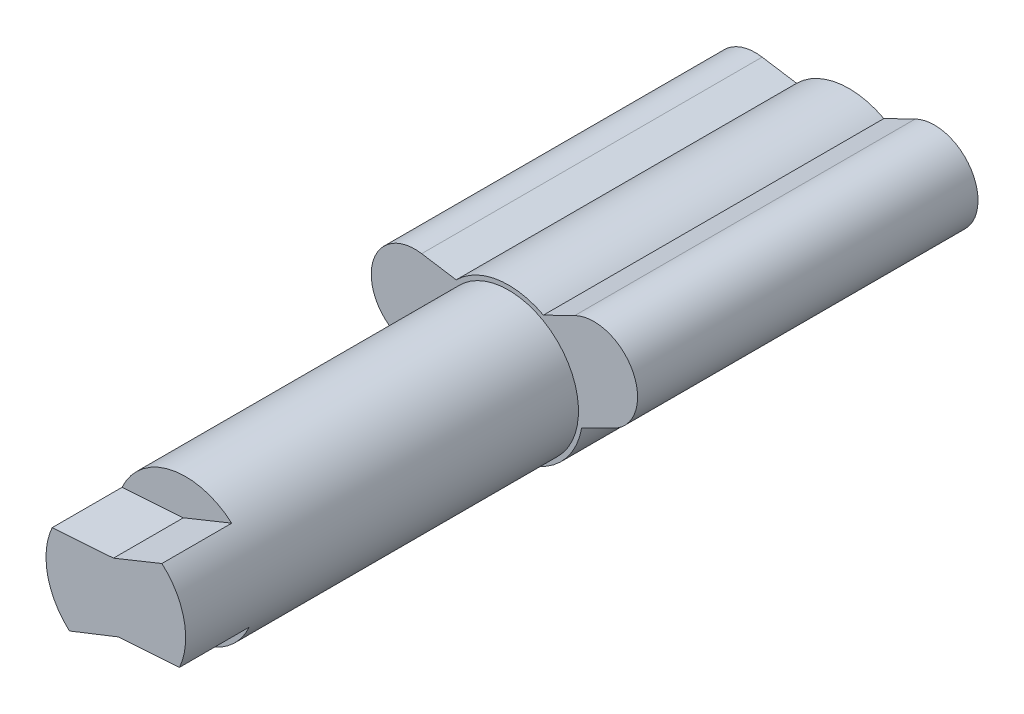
from build123d import *

# Parameters (mm, degrees)
ESQUISSE1_R             = 4
EXTRUSION1_DEPTH        = 42
ENL_V_START             = -4
ENL_V_MAT_EXTRU_1_DEPTH = 4
EXTRUSION2_DEPTH        = 19.5


with BuildPart() as part:
    # Esquisse1 → Extrusion1 (new body)
    with BuildSketch(Plane.XY):
        with Locations(Location((0, 0, 0), (0, 0, 180))):
            Circle(ESQUISSE1_R)
    extrude(amount=EXTRUSION1_DEPTH)

    # Esquisse2 → Enl_v. mat.-Extru.1 (cut)
    with BuildSketch(Plane.XY.offset(42).offset(ENL_V_START)):
        with BuildLine():
            Line((0.132023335, -1.888021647), (3.647349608, -1.642206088))
            ThreePointArc((3.647349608, -1.642206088), (0.835737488, -3.911718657), (-2.657828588, -2.989305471))
            Line((-2.657828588, -2.989305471), (0.132023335, -1.888021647))
        make_face()
        with BuildLine():
            Line((-0.132023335, 1.888021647), (2.638451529, 3.006422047))
            ThreePointArc((2.638451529, 3.006422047), (-0.848374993, 3.908997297), (-3.647349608, 1.642206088))
            Line((-3.647349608, 1.642206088), (-0.132023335, 1.888021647))
        make_face()
    extrude(amount=ENL_V_MAT_EXTRU_1_DEPTH, mode=Mode.SUBTRACT)

    # Esquisse3 → Extrusion2 (add)
    with BuildSketch(Plane(origin=(0, 0, 0), x_dir=(-1, 0, 0), z_dir=(0, 0, -1))):
        with BuildLine():
            Line((5.760382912, -1.621177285), (3.784871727, -1.933195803))
            ThreePointArc((3.784871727, -1.933195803), (-0.629999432, -4.203046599), (-4.18534, -0.738531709))
            Line((-4.18534, -0.738531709), (-5.982550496, 0.13898435))
            ThreePointArc((-5.982550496, 0.13898435), (-7.132168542, 3.482392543), (-3.788760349, 4.63201059))
            Line((-3.788760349, 4.63201059), (-1.991549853, 3.754494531))
            ThreePointArc((-1.991549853, 3.754494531), (0.629999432, 4.203046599), (3.004825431, 3.005582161))
            Line((3.004825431, 3.005582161), (4.980336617, 3.317600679))
            ThreePointArc((4.980336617, 3.317600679), (7.839748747, 1.238234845), (5.760382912, -1.621177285))
        make_face()
    extrude(amount=-EXTRUSION2_DEPTH)


solid = part.part
